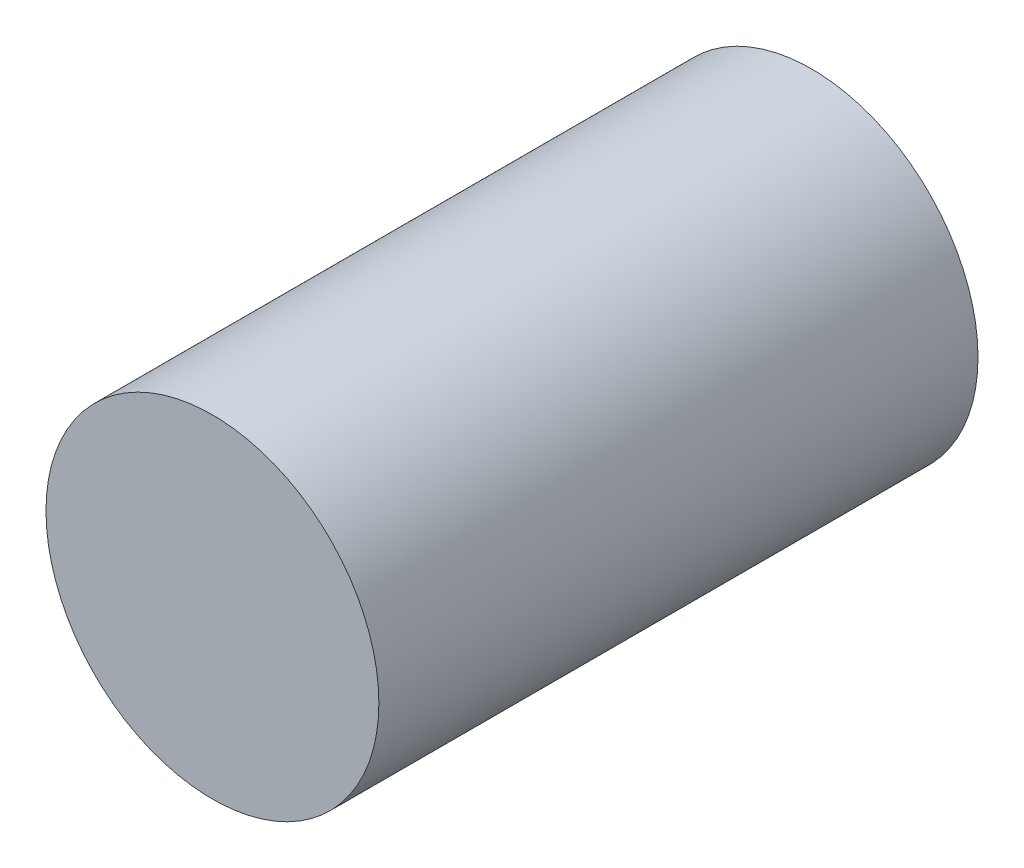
ISO-10303-21;
HEADER;
FILE_DESCRIPTION(('STEP AP214'),'2;1');
FILE_NAME('part.step','',(''),(''),'','','');
FILE_SCHEMA(('AUTOMOTIVE_DESIGN { 1 0 10303 214 1 1 1 1 }'));
ENDSEC;
DATA;
#1=APPLICATION_CONTEXT('core data for automotive mechanical design processes');
#2=APPLICATION_PROTOCOL_DEFINITION('international standard','automotive_design',2000,#1);
#3=PRODUCT_CONTEXT('',#1,'mechanical');
#4=PRODUCT('Part','Part','',(#3));
#5=PRODUCT_RELATED_PRODUCT_CATEGORY('part','',(#4));
#6=PRODUCT_DEFINITION_FORMATION('','',#4);
#7=PRODUCT_DEFINITION_CONTEXT('part definition',#1,'design');
#8=PRODUCT_DEFINITION('design','',#6,#7);
#9=PRODUCT_DEFINITION_SHAPE('','',#8);
#10=(LENGTH_UNIT() NAMED_UNIT(*) SI_UNIT(.MILLI.,.METRE.));
#11=(NAMED_UNIT(*) PLANE_ANGLE_UNIT() SI_UNIT($,.RADIAN.));
#12=(NAMED_UNIT(*) SI_UNIT($,.STERADIAN.) SOLID_ANGLE_UNIT());
#13=UNCERTAINTY_MEASURE_WITH_UNIT(LENGTH_MEASURE(1.E-05),#10,'distance_accuracy_value','');
#14=(GEOMETRIC_REPRESENTATION_CONTEXT(3) GLOBAL_UNCERTAINTY_ASSIGNED_CONTEXT((#13)) GLOBAL_UNIT_ASSIGNED_CONTEXT((#10,
#11,#12)) REPRESENTATION_CONTEXT('',''));
#15=CARTESIAN_POINT('',(0.,0.,0.));
#16=DIRECTION('',(0.,0.,1.));
#17=DIRECTION('',(1.,0.,0.));
#18=AXIS2_PLACEMENT_3D('',#15,#16,#17);
#19=CARTESIAN_POINT('',(0.,0.,1920.24));
#20=DIRECTION('',(0.,0.,-1.));
#21=DIRECTION('',(-1.,0.,0.));
#22=AXIS2_PLACEMENT_3D('',#19,#20,#21);
#23=CYLINDRICAL_SURFACE('',#22,533.4);
#24=CARTESIAN_POINT('',(0.,0.,1920.24));
#25=DIRECTION('',(0.,0.,1.));
#26=DIRECTION('',(1.,0.,0.));
#27=AXIS2_PLACEMENT_3D('',#24,#25,#26);
#28=CIRCLE('',#27,533.4);
#29=CARTESIAN_POINT('',(-533.4,0.,1920.24));
#30=VERTEX_POINT('',#29);
#31=EDGE_CURVE('E10',#30,#30,#28,.T.);
#32=CARTESIAN_POINT('',(0.,0.,0.));
#33=DIRECTION('',(0.,0.,1.));
#34=DIRECTION('',(1.,0.,0.));
#35=AXIS2_PLACEMENT_3D('',#32,#33,#34);
#36=CIRCLE('',#35,533.4);
#37=CARTESIAN_POINT('',(-533.4,0.,-2.22044604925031E-13));
#38=VERTEX_POINT('',#37);
#39=EDGE_CURVE('E46',#38,#38,#36,.T.);
#40=CARTESIAN_POINT('',(-533.4,0.,1920.24));
#41=CARTESIAN_POINT('',(-533.4,0.,1900.2375));
#42=CARTESIAN_POINT('',(-533.4,0.,1880.235));
#43=CARTESIAN_POINT('',(-533.4,0.,1840.23));
#44=CARTESIAN_POINT('',(-533.4,0.,1820.2275));
#45=CARTESIAN_POINT('',(-533.4,0.,1780.2225));
#46=CARTESIAN_POINT('',(-533.4,0.,1760.22));
#47=CARTESIAN_POINT('',(-533.4,0.,1720.215));
#48=CARTESIAN_POINT('',(-533.4,0.,1700.2125));
#49=CARTESIAN_POINT('',(-533.4,0.,1660.2075));
#50=CARTESIAN_POINT('',(-533.4,0.,1640.205));
#51=CARTESIAN_POINT('',(-533.4,0.,1600.2));
#52=CARTESIAN_POINT('',(-533.4,0.,1580.1975));
#53=CARTESIAN_POINT('',(-533.4,0.,1540.1925));
#54=CARTESIAN_POINT('',(-533.4,0.,1520.19));
#55=CARTESIAN_POINT('',(-533.4,0.,1480.185));
#56=CARTESIAN_POINT('',(-533.4,0.,1460.1825));
#57=CARTESIAN_POINT('',(-533.4,0.,1420.1775));
#58=CARTESIAN_POINT('',(-533.4,0.,1400.175));
#59=CARTESIAN_POINT('',(-533.4,0.,1360.17));
#60=CARTESIAN_POINT('',(-533.4,0.,1340.1675));
#61=CARTESIAN_POINT('',(-533.4,0.,1300.1625));
#62=CARTESIAN_POINT('',(-533.4,0.,1280.16));
#63=CARTESIAN_POINT('',(-533.4,0.,1240.155));
#64=CARTESIAN_POINT('',(-533.4,0.,1220.1525));
#65=CARTESIAN_POINT('',(-533.4,0.,1180.1475));
#66=CARTESIAN_POINT('',(-533.4,0.,1160.145));
#67=CARTESIAN_POINT('',(-533.4,0.,1120.14));
#68=CARTESIAN_POINT('',(-533.4,0.,1100.1375));
#69=CARTESIAN_POINT('',(-533.4,0.,1060.1325));
#70=CARTESIAN_POINT('',(-533.4,0.,1040.13));
#71=CARTESIAN_POINT('',(-533.4,0.,1000.125));
#72=CARTESIAN_POINT('',(-533.4,0.,980.1225));
#73=CARTESIAN_POINT('',(-533.4,0.,940.1175));
#74=CARTESIAN_POINT('',(-533.4,0.,920.115));
#75=CARTESIAN_POINT('',(-533.4,0.,880.11));
#76=CARTESIAN_POINT('',(-533.4,0.,860.1075));
#77=CARTESIAN_POINT('',(-533.4,0.,820.1025));
#78=CARTESIAN_POINT('',(-533.4,0.,800.1));
#79=CARTESIAN_POINT('',(-533.4,0.,760.095));
#80=CARTESIAN_POINT('',(-533.4,0.,740.0925));
#81=CARTESIAN_POINT('',(-533.4,0.,700.0875));
#82=CARTESIAN_POINT('',(-533.4,0.,680.085));
#83=CARTESIAN_POINT('',(-533.4,0.,640.08));
#84=CARTESIAN_POINT('',(-533.4,0.,620.0775));
#85=CARTESIAN_POINT('',(-533.4,0.,580.0725));
#86=CARTESIAN_POINT('',(-533.4,0.,560.07));
#87=CARTESIAN_POINT('',(-533.4,0.,520.065));
#88=CARTESIAN_POINT('',(-533.4,0.,500.0625));
#89=CARTESIAN_POINT('',(-533.4,0.,460.0575));
#90=CARTESIAN_POINT('',(-533.4,0.,440.055));
#91=CARTESIAN_POINT('',(-533.4,0.,400.05));
#92=CARTESIAN_POINT('',(-533.4,0.,380.0475));
#93=CARTESIAN_POINT('',(-533.4,0.,340.0425));
#94=CARTESIAN_POINT('',(-533.4,0.,320.04));
#95=CARTESIAN_POINT('',(-533.4,0.,280.035));
#96=CARTESIAN_POINT('',(-533.4,0.,260.0325));
#97=CARTESIAN_POINT('',(-533.4,0.,220.0275));
#98=CARTESIAN_POINT('',(-533.4,0.,200.025));
#99=CARTESIAN_POINT('',(-533.4,0.,160.02));
#100=CARTESIAN_POINT('',(-533.4,0.,140.0175));
#101=CARTESIAN_POINT('',(-533.4,0.,100.0125));
#102=CARTESIAN_POINT('',(-533.4,0.,80.0099999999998));
#103=CARTESIAN_POINT('',(-533.4,0.,40.0049999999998));
#104=CARTESIAN_POINT('',(-533.4,0.,20.0024999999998));
#105=CARTESIAN_POINT('',(-533.4,0.,-2.22044604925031E-13));
#106=B_SPLINE_CURVE_WITH_KNOTS('',3,(#40,#41,#42,#43,#44,#45,#46,#47,#48,#49,#50,#51,#52,#53,
#54,#55,#56,#57,#58,#59,#60,#61,#62,#63,#64,#65,#66,#67,#68,#69,#70,#71,#72,#73,#74,#75,#76,#77,
#78,#79,#80,#81,#82,#83,#84,#85,#86,#87,#88,#89,#90,#91,#92,#93,#94,#95,#96,#97,#98,#99,#100,
#101,#102,#103,#104,#105),.UNSPECIFIED.,.F.,.F.,(4,2,2,2,2,2,2,2,2,2,2,2,2,2,2,2,2,2,2,2,2,2,2,
2,2,2,2,2,2,2,2,2,4),(0.,60.0075,120.015,180.0225,240.03,300.0375,360.045,420.0525,480.06,
540.0675,600.075,660.0825,720.09,780.0975,840.105,900.1125,960.12,1020.1275,1080.135,1140.1425,
1200.15,1260.1575,1320.165,1380.1725,1440.18,1500.1875,1560.195,1620.2025,1680.21,1740.2175,
1800.225,1860.2325,1920.24),.UNSPECIFIED.);
#107=EDGE_CURVE('BSEAM43',#30,#38,#106,.T.);
#108=ORIENTED_EDGE('',*,*,#31,.F.);
#109=ORIENTED_EDGE('',*,*,#39,.T.);
#110=ORIENTED_EDGE('',*,*,#107,.T.);
#111=ORIENTED_EDGE('',*,*,#107,.F.);
#112=EDGE_LOOP('',(#108,#110,#109,#111));
#113=FACE_BOUND('',#112,.T.);
#114=ADVANCED_FACE('F43',(#113),#23,.T.);
#115=CARTESIAN_POINT('',(0.,0.,1920.24));
#116=DIRECTION('',(0.,0.,1.));
#117=DIRECTION('',(1.,0.,0.));
#118=AXIS2_PLACEMENT_3D('',#115,#116,#117);
#119=PLANE('',#118);
#120=ORIENTED_EDGE('',*,*,#31,.T.);
#121=EDGE_LOOP('',(#120));
#122=FACE_BOUND('',#121,.T.);
#123=ADVANCED_FACE('F58',(#122),#119,.T.);
#124=CARTESIAN_POINT('',(0.,0.,0.));
#125=DIRECTION('',(0.,0.,1.));
#126=DIRECTION('',(1.,0.,0.));
#127=AXIS2_PLACEMENT_3D('',#124,#125,#126);
#128=PLANE('',#127);
#129=ORIENTED_EDGE('',*,*,#39,.F.);
#130=EDGE_LOOP('',(#129));
#131=FACE_BOUND('',#130,.T.);
#132=ADVANCED_FACE('F59',(#131),#128,.F.);
#133=CLOSED_SHELL('',(#114,#123,#132));
#134=MANIFOLD_SOLID_BREP('B2',#133);
#135=ADVANCED_BREP_SHAPE_REPRESENTATION('',(#18,#134),#14);
#136=SHAPE_DEFINITION_REPRESENTATION(#9,#135);
ENDSEC;
END-ISO-10303-21;
